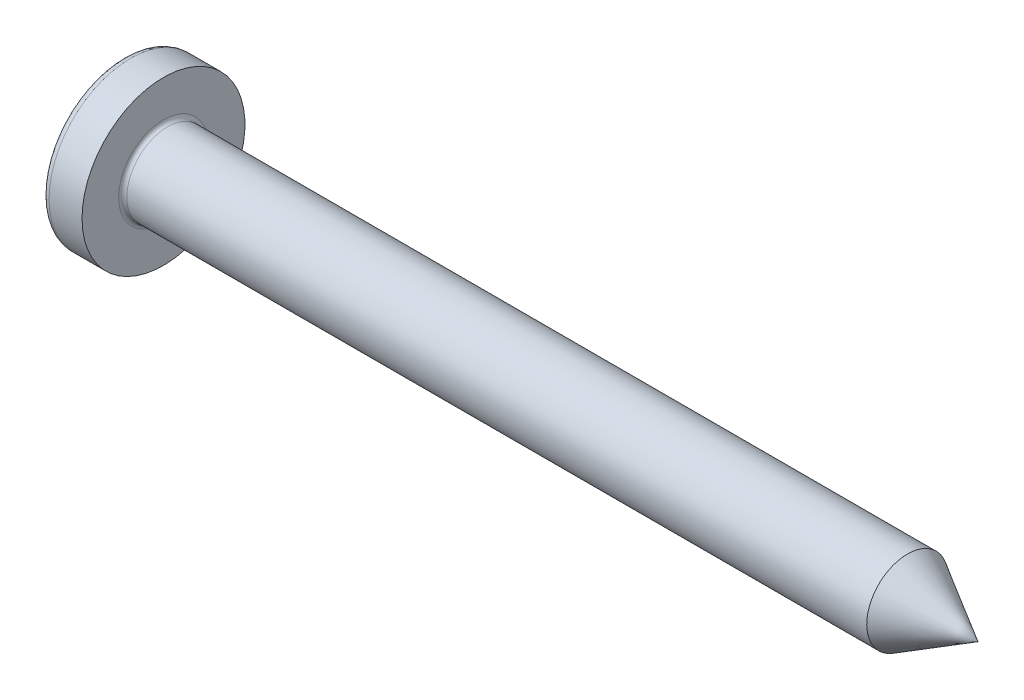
ISO-10303-21;
HEADER;
FILE_DESCRIPTION(('STEP AP214'),'2;1');
FILE_NAME('part.step','',(''),(''),'','','');
FILE_SCHEMA(('AUTOMOTIVE_DESIGN { 1 0 10303 214 1 1 1 1 }'));
ENDSEC;
DATA;
#1=APPLICATION_CONTEXT('core data for automotive mechanical design processes');
#2=APPLICATION_PROTOCOL_DEFINITION('international standard','automotive_design',2000,#1);
#3=PRODUCT_CONTEXT('',#1,'mechanical');
#4=PRODUCT('Part','Part','',(#3));
#5=PRODUCT_RELATED_PRODUCT_CATEGORY('part','',(#4));
#6=PRODUCT_DEFINITION_FORMATION('','',#4);
#7=PRODUCT_DEFINITION_CONTEXT('part definition',#1,'design');
#8=PRODUCT_DEFINITION('design','',#6,#7);
#9=PRODUCT_DEFINITION_SHAPE('','',#8);
#10=(LENGTH_UNIT() NAMED_UNIT(*) SI_UNIT(.MILLI.,.METRE.));
#11=(NAMED_UNIT(*) PLANE_ANGLE_UNIT() SI_UNIT($,.RADIAN.));
#12=(NAMED_UNIT(*) SI_UNIT($,.STERADIAN.) SOLID_ANGLE_UNIT());
#13=UNCERTAINTY_MEASURE_WITH_UNIT(LENGTH_MEASURE(1.E-05),#10,'distance_accuracy_value','');
#14=(GEOMETRIC_REPRESENTATION_CONTEXT(3) GLOBAL_UNCERTAINTY_ASSIGNED_CONTEXT((#13)) GLOBAL_UNIT_ASSIGNED_CONTEXT((#10,
#11,#12)) REPRESENTATION_CONTEXT('',''));
#15=CARTESIAN_POINT('',(0.,0.,0.));
#16=DIRECTION('',(0.,0.,1.));
#17=DIRECTION('',(1.,0.,0.));
#18=AXIS2_PLACEMENT_3D('',#15,#16,#17);
#19=CARTESIAN_POINT('',(3.2,0.,0.));
#20=DIRECTION('',(-1.,0.,0.));
#21=DIRECTION('',(0.,1.,0.));
#22=AXIS2_PLACEMENT_3D('',#19,#20,#21);
#23=SPHERICAL_SURFACE('',#22,3.2);
#24=CARTESIAN_POINT('',(0.646379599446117,0.,0.));
#25=DIRECTION('',(-1.,0.,0.));
#26=DIRECTION('',(0.,0.,1.));
#27=AXIS2_PLACEMENT_3D('',#24,#25,#26);
#28=CIRCLE('',#27,1.92847682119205);
#29=CARTESIAN_POINT('',(0.646379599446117,0.,1.92847682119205));
#30=VERTEX_POINT('',#29);
#31=EDGE_CURVE('E338',#30,#30,#28,.T.);
#32=ORIENTED_EDGE('',*,*,#31,.T.);
#33=EDGE_LOOP('',(#32));
#34=FACE_BOUND('',#33,.T.);
#35=CARTESIAN_POINT('',(0.0321614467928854,0.,0.));
#36=DIRECTION('',(1.,0.,0.));
#37=DIRECTION('',(0.,0.,-1.));
#38=AXIS2_PLACEMENT_3D('',#35,#36,#37);
#39=CIRCLE('',#38,0.452547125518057);
#40=CARTESIAN_POINT('',(0.0321614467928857,-0.239999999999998,-0.38366508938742));
#41=VERTEX_POINT('',#40);
#42=CARTESIAN_POINT('',(0.0321614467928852,-0.383665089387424,-0.24));
#43=VERTEX_POINT('',#42);
#44=EDGE_CURVE('E409',#41,#43,#39,.F.);
#45=ORIENTED_EDGE('',*,*,#44,.F.);
#46=CARTESIAN_POINT('',(3.2,-0.24,0.));
#47=DIRECTION('',(0.,1.,0.));
#48=DIRECTION('',(0.,0.,1.));
#49=AXIS2_PLACEMENT_3D('',#46,#47,#48);
#50=CIRCLE('',#49,3.19098730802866);
#51=CARTESIAN_POINT('',(0.160076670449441,-0.239999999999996,-0.970188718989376));
#52=VERTEX_POINT('',#51);
#53=EDGE_CURVE('E371',#52,#41,#50,.T.);
#54=ORIENTED_EDGE('',*,*,#53,.F.);
#55=CARTESIAN_POINT('',(2.98218770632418,0.,0.436863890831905));
#56=DIRECTION('',(0.446197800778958,0.,-0.89493436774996));
#57=DIRECTION('',(-0.89493436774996,0.,-0.446197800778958));
#58=AXIS2_PLACEMENT_3D('',#55,#56,#57);
#59=CIRCLE('',#58,3.16254766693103);
#60=CARTESIAN_POINT('',(0.160076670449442,0.240000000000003,-0.970188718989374));
#61=VERTEX_POINT('',#60);
#62=EDGE_CURVE('E207',#52,#61,#59,.T.);
#63=ORIENTED_EDGE('',*,*,#62,.T.);
#64=CARTESIAN_POINT('',(3.2,0.24,0.));
#65=DIRECTION('',(0.,-1.,0.));
#66=DIRECTION('',(0.,0.,-1.));
#67=AXIS2_PLACEMENT_3D('',#64,#65,#66);
#68=CIRCLE('',#67,3.19098730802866);
#69=CARTESIAN_POINT('',(0.0321614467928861,0.240000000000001,-0.383665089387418));
#70=VERTEX_POINT('',#69);
#71=EDGE_CURVE('E370',#70,#61,#68,.T.);
#72=ORIENTED_EDGE('',*,*,#71,.F.);
#73=CARTESIAN_POINT('',(0.0321614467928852,0.383665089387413,-0.24));
#74=VERTEX_POINT('',#73);
#75=EDGE_CURVE('E413',#74,#70,#39,.F.);
#76=ORIENTED_EDGE('',*,*,#75,.F.);
#77=CARTESIAN_POINT('',(3.2,0.,-0.24));
#78=DIRECTION('',(0.,0.,1.));
#79=DIRECTION('',(1.,0.,0.));
#80=AXIS2_PLACEMENT_3D('',#77,#78,#79);
#81=CIRCLE('',#80,3.19098730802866);
#82=CARTESIAN_POINT('',(0.160076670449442,0.970188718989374,-0.24));
#83=VERTEX_POINT('',#82);
#84=EDGE_CURVE('E201',#83,#74,#81,.T.);
#85=ORIENTED_EDGE('',*,*,#84,.F.);
#86=CARTESIAN_POINT('',(2.98218770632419,-0.436863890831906,0.));
#87=DIRECTION('',(0.446197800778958,0.89493436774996,0.));
#88=DIRECTION('',(-0.89493436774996,0.446197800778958,0.));
#89=AXIS2_PLACEMENT_3D('',#86,#87,#88);
#90=CIRCLE('',#89,3.16254766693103);
#91=CARTESIAN_POINT('',(0.160076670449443,0.970188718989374,0.24));
#92=VERTEX_POINT('',#91);
#93=EDGE_CURVE('E204',#83,#92,#90,.T.);
#94=ORIENTED_EDGE('',*,*,#93,.T.);
#95=CARTESIAN_POINT('',(3.2,0.,0.24));
#96=DIRECTION('',(0.,0.,-1.));
#97=DIRECTION('',(-1.,0.,0.));
#98=AXIS2_PLACEMENT_3D('',#95,#96,#97);
#99=CIRCLE('',#98,3.19098730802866);
#100=CARTESIAN_POINT('',(0.0321614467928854,0.383665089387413,0.239999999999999));
#101=VERTEX_POINT('',#100);
#102=EDGE_CURVE('E190',#101,#92,#99,.T.);
#103=ORIENTED_EDGE('',*,*,#102,.F.);
#104=CARTESIAN_POINT('',(0.0321614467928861,0.239999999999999,0.38366508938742));
#105=VERTEX_POINT('',#104);
#106=EDGE_CURVE('E275',#105,#101,#39,.F.);
#107=ORIENTED_EDGE('',*,*,#106,.F.);
#108=CARTESIAN_POINT('',(0.160076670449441,0.239999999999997,0.970188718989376));
#109=VERTEX_POINT('',#108);
#110=EDGE_CURVE('E368',#109,#105,#68,.T.);
#111=ORIENTED_EDGE('',*,*,#110,.F.);
#112=CARTESIAN_POINT('',(2.98218770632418,0.,-0.436863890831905));
#113=DIRECTION('',(0.446197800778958,0.,0.89493436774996));
#114=DIRECTION('',(0.89493436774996,0.,-0.446197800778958));
#115=AXIS2_PLACEMENT_3D('',#112,#113,#114);
#116=CIRCLE('',#115,3.16254766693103);
#117=CARTESIAN_POINT('',(0.160076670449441,-0.240000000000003,0.970188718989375));
#118=VERTEX_POINT('',#117);
#119=EDGE_CURVE('E210',#109,#118,#116,.T.);
#120=ORIENTED_EDGE('',*,*,#119,.T.);
#121=CARTESIAN_POINT('',(0.0321614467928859,-0.240000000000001,0.383665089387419));
#122=VERTEX_POINT('',#121);
#123=EDGE_CURVE('E372',#122,#118,#50,.T.);
#124=ORIENTED_EDGE('',*,*,#123,.F.);
#125=CARTESIAN_POINT('',(0.0321614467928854,-0.383665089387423,0.239999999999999));
#126=VERTEX_POINT('',#125);
#127=EDGE_CURVE('E408',#126,#122,#39,.F.);
#128=ORIENTED_EDGE('',*,*,#127,.F.);
#129=CARTESIAN_POINT('',(0.160076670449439,-0.970188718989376,0.239999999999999));
#130=VERTEX_POINT('',#129);
#131=EDGE_CURVE('E197',#130,#126,#99,.T.);
#132=ORIENTED_EDGE('',*,*,#131,.F.);
#133=CARTESIAN_POINT('',(2.98218770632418,0.436863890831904,0.));
#134=DIRECTION('',(0.446197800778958,-0.89493436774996,0.));
#135=DIRECTION('',(0.89493436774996,0.446197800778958,0.));
#136=AXIS2_PLACEMENT_3D('',#133,#134,#135);
#137=CIRCLE('',#136,3.16254766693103);
#138=CARTESIAN_POINT('',(0.160076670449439,-0.970188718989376,-0.24));
#139=VERTEX_POINT('',#138);
#140=EDGE_CURVE('E186',#130,#139,#137,.T.);
#141=ORIENTED_EDGE('',*,*,#140,.T.);
#142=EDGE_CURVE('E200',#43,#139,#81,.T.);
#143=ORIENTED_EDGE('',*,*,#142,.F.);
#144=EDGE_LOOP('',(#45,#54,#63,#72,#76,#85,#94,#103,#107,#111,#120,#124,#128,#132,#141,#143));
#145=FACE_BOUND('',#144,.T.);
#146=ADVANCED_FACE('F31',(#34,#145),#23,.T.);
#147=CARTESIAN_POINT('',(1.42,0.342014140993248,-0.24));
#148=DIRECTION('',(0.,0.,1.));
#149=DIRECTION('',(1.,0.,0.));
#150=AXIS2_PLACEMENT_3D('',#147,#148,#149);
#151=PLANE('',#150);
#152=ORIENTED_EDGE('',*,*,#84,.T.);
#153=CARTESIAN_POINT('',(-0.626811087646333,0.437068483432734,-0.24));
#154=CARTESIAN_POINT('',(-0.489788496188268,0.426133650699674,-0.24));
#155=CARTESIAN_POINT('',(-0.35277275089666,0.415111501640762,-0.24));
#156=CARTESIAN_POINT('',(-0.0787578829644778,0.392826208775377,-0.24));
#157=CARTESIAN_POINT('',(0.0582412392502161,0.381563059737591,-0.24));
#158=CARTESIAN_POINT('',(0.332213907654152,0.358729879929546,-0.24));
#159=CARTESIAN_POINT('',(0.469187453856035,0.347159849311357,-0.24));
#160=CARTESIAN_POINT('',(0.743097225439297,0.323608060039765,-0.24));
#161=CARTESIAN_POINT('',(0.880033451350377,0.311626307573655,-0.24));
#162=CARTESIAN_POINT('',(1.12503843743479,0.289667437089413,-0.24));
#163=CARTESIAN_POINT('',(1.23311691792,0.279799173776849,-0.24));
#164=CARTESIAN_POINT('',(1.4492267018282,0.259570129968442,-0.24));
#165=CARTESIAN_POINT('',(1.55725800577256,0.249209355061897,-0.24));
#166=CARTESIAN_POINT('',(1.77325939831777,0.227783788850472,-0.24));
#167=CARTESIAN_POINT('',(1.88122948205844,0.216718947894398,-0.24));
#168=CARTESIAN_POINT('',(2.04309848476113,0.199296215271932,-0.24));
#169=CARTESIAN_POINT('',(2.09704158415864,0.193350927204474,-0.24));
#170=CARTESIAN_POINT('',(2.20488609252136,0.181086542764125,-0.24));
#171=CARTESIAN_POINT('',(2.25878750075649,0.174767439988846,-0.24));
#172=CARTESIAN_POINT('',(2.31266102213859,0.168212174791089,-0.24));
#173=B_SPLINE_CURVE_WITH_KNOTS('',3,(#153,#154,#155,#156,#157,#158,#159,#160,#161,#162,#163,
#164,#165,#166,#167,#168,#169,#170,#171,#172),.UNSPECIFIED.,.F.,.F.,(4,2,2,2,2,2,2,2,2,4),(0.,
0.412374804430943,0.824758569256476,1.23714212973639,1.64951949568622,1.97510284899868,
2.30068250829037,2.62628515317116,2.78909323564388,2.95190410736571),.UNSPECIFIED.);
#174=CARTESIAN_POINT('',(1.42,0.262259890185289,-0.240000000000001));
#175=VERTEX_POINT('',#174);
#176=EDGE_CURVE('E251',#74,#175,#173,.T.);
#177=ORIENTED_EDGE('',*,*,#176,.T.);
#178=DIRECTION('',(0.,1.,0.));
#179=VECTOR('',#178,1.);
#180=CARTESIAN_POINT('',(1.42,-0.342014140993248,-0.24));
#181=LINE('',#180,#179);
#182=CARTESIAN_POINT('',(1.42,0.342014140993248,-0.24));
#183=VERTEX_POINT('',#182);
#184=EDGE_CURVE('E347',#175,#183,#181,.T.);
#185=ORIENTED_EDGE('',*,*,#184,.T.);
#186=DIRECTION('',(0.89493436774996,-0.446197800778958,0.));
#187=VECTOR('',#186,1.);
#188=CARTESIAN_POINT('',(0.,1.05,-0.24));
#189=LINE('',#188,#187);
#190=EDGE_CURVE('E342',#83,#183,#189,.T.);
#191=ORIENTED_EDGE('',*,*,#190,.F.);
#192=EDGE_LOOP('',(#152,#177,#185,#191));
#193=FACE_BOUND('',#192,.T.);
#194=ADVANCED_FACE('F302',(#193),#151,.T.);
#195=CARTESIAN_POINT('',(1.42,-0.342014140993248,-0.24));
#196=VERTEX_POINT('',#195);
#197=CARTESIAN_POINT('',(1.42,-0.262259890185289,-0.240000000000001));
#198=VERTEX_POINT('',#197);
#199=EDGE_CURVE('E343',#196,#198,#181,.T.);
#200=ORIENTED_EDGE('',*,*,#199,.T.);
#201=CARTESIAN_POINT('',(-0.626811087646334,-0.437068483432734,-0.24));
#202=CARTESIAN_POINT('',(-0.489788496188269,-0.426133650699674,-0.24));
#203=CARTESIAN_POINT('',(-0.352772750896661,-0.415111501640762,-0.24));
#204=CARTESIAN_POINT('',(-0.0787578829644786,-0.392826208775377,-0.24));
#205=CARTESIAN_POINT('',(0.0582412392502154,-0.381563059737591,-0.24));
#206=CARTESIAN_POINT('',(0.332213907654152,-0.358729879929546,-0.24));
#207=CARTESIAN_POINT('',(0.469187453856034,-0.347159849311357,-0.24));
#208=CARTESIAN_POINT('',(0.743097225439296,-0.323608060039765,-0.24));
#209=CARTESIAN_POINT('',(0.880033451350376,-0.311626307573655,-0.24));
#210=CARTESIAN_POINT('',(1.12503843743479,-0.289667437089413,-0.24));
#211=CARTESIAN_POINT('',(1.23311691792,-0.279799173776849,-0.24));
#212=CARTESIAN_POINT('',(1.4492267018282,-0.259570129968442,-0.24));
#213=CARTESIAN_POINT('',(1.55725800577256,-0.249209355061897,-0.24));
#214=CARTESIAN_POINT('',(1.77325939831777,-0.227783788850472,-0.24));
#215=CARTESIAN_POINT('',(1.88122948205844,-0.216718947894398,-0.24));
#216=CARTESIAN_POINT('',(2.04309848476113,-0.199296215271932,-0.24));
#217=CARTESIAN_POINT('',(2.09704158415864,-0.193350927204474,-0.24));
#218=CARTESIAN_POINT('',(2.20488609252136,-0.181086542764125,-0.24));
#219=CARTESIAN_POINT('',(2.25878750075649,-0.174767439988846,-0.24));
#220=CARTESIAN_POINT('',(2.31266102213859,-0.168212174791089,-0.24));
#221=B_SPLINE_CURVE_WITH_KNOTS('',3,(#201,#202,#203,#204,#205,#206,#207,#208,#209,#210,#211,
#212,#213,#214,#215,#216,#217,#218,#219,#220),.UNSPECIFIED.,.F.,.F.,(4,2,2,2,2,2,2,2,2,4),(0.,
0.412374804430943,0.824758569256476,1.23714212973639,1.64951949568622,1.97510284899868,
2.30068250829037,2.62628515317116,2.78909323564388,2.95190410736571),.UNSPECIFIED.);
#222=EDGE_CURVE('E237',#198,#43,#221,.F.);
#223=ORIENTED_EDGE('',*,*,#222,.T.);
#224=ORIENTED_EDGE('',*,*,#142,.T.);
#225=DIRECTION('',(0.89493436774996,0.446197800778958,0.));
#226=VECTOR('',#225,1.);
#227=CARTESIAN_POINT('',(0.,-1.05,-0.24));
#228=LINE('',#227,#226);
#229=EDGE_CURVE('E362',#139,#196,#228,.T.);
#230=ORIENTED_EDGE('',*,*,#229,.T.);
#231=EDGE_LOOP('',(#200,#223,#224,#230));
#232=FACE_BOUND('',#231,.T.);
#233=ADVANCED_FACE('F308',(#232),#151,.T.);
#234=CARTESIAN_POINT('',(1.42,-0.342014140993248,0.24));
#235=DIRECTION('',(0.,0.,-1.));
#236=DIRECTION('',(-1.,0.,0.));
#237=AXIS2_PLACEMENT_3D('',#234,#235,#236);
#238=PLANE('',#237);
#239=DIRECTION('',(0.,-1.,0.));
#240=VECTOR('',#239,1.);
#241=CARTESIAN_POINT('',(1.42,0.342014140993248,0.24));
#242=LINE('',#241,#240);
#243=CARTESIAN_POINT('',(1.42,0.342014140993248,0.24));
#244=VERTEX_POINT('',#243);
#245=CARTESIAN_POINT('',(1.42,0.262259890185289,0.240000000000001));
#246=VERTEX_POINT('',#245);
#247=EDGE_CURVE('E352',#244,#246,#242,.T.);
#248=ORIENTED_EDGE('',*,*,#247,.T.);
#249=CARTESIAN_POINT('',(-0.626811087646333,0.437068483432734,0.239999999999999));
#250=CARTESIAN_POINT('',(-0.489788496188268,0.426133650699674,0.239999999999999));
#251=CARTESIAN_POINT('',(-0.35277275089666,0.415111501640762,0.239999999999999));
#252=CARTESIAN_POINT('',(-0.0787578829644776,0.392826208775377,0.239999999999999));
#253=CARTESIAN_POINT('',(0.0582412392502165,0.381563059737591,0.239999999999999));
#254=CARTESIAN_POINT('',(0.332213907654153,0.358729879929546,0.239999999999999));
#255=CARTESIAN_POINT('',(0.469187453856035,0.347159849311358,0.239999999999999));
#256=CARTESIAN_POINT('',(0.743097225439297,0.323608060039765,0.24));
#257=CARTESIAN_POINT('',(0.880033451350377,0.311626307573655,0.24));
#258=CARTESIAN_POINT('',(1.12503843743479,0.289667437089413,0.24));
#259=CARTESIAN_POINT('',(1.23311691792,0.279799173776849,0.24));
#260=CARTESIAN_POINT('',(1.4492267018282,0.259570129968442,0.24));
#261=CARTESIAN_POINT('',(1.55725800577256,0.249209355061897,0.24));
#262=CARTESIAN_POINT('',(1.77325939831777,0.227783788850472,0.24));
#263=CARTESIAN_POINT('',(1.88122948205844,0.216718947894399,0.24));
#264=CARTESIAN_POINT('',(2.04309848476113,0.199296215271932,0.24));
#265=CARTESIAN_POINT('',(2.09704158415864,0.193350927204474,0.24));
#266=CARTESIAN_POINT('',(2.20488609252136,0.181086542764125,0.24));
#267=CARTESIAN_POINT('',(2.25878750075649,0.174767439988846,0.24));
#268=CARTESIAN_POINT('',(2.31266102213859,0.168212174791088,0.24));
#269=B_SPLINE_CURVE_WITH_KNOTS('',3,(#249,#250,#251,#252,#253,#254,#255,#256,#257,#258,#259,
#260,#261,#262,#263,#264,#265,#266,#267,#268),.UNSPECIFIED.,.F.,.F.,(4,2,2,2,2,2,2,2,2,4),(0.,
0.412374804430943,0.824758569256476,1.23714212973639,1.64951949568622,1.97510284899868,
2.30068250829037,2.62628515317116,2.78909323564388,2.95190410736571),.UNSPECIFIED.);
#270=EDGE_CURVE('E276',#246,#101,#269,.F.);
#271=ORIENTED_EDGE('',*,*,#270,.T.);
#272=ORIENTED_EDGE('',*,*,#102,.T.);
#273=DIRECTION('',(0.89493436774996,-0.446197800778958,0.));
#274=VECTOR('',#273,1.);
#275=CARTESIAN_POINT('',(0.,1.05,0.24));
#276=LINE('',#275,#274);
#277=EDGE_CURVE('E364',#92,#244,#276,.T.);
#278=ORIENTED_EDGE('',*,*,#277,.T.);
#279=EDGE_LOOP('',(#248,#271,#272,#278));
#280=FACE_BOUND('',#279,.T.);
#281=ADVANCED_FACE('F446',(#280),#238,.T.);
#282=ORIENTED_EDGE('',*,*,#131,.T.);
#283=CARTESIAN_POINT('',(-0.626811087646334,-0.437068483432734,0.239999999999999));
#284=CARTESIAN_POINT('',(-0.489788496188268,-0.426133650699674,0.239999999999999));
#285=CARTESIAN_POINT('',(-0.35277275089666,-0.415111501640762,0.239999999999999));
#286=CARTESIAN_POINT('',(-0.0787578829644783,-0.392826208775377,0.239999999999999));
#287=CARTESIAN_POINT('',(0.0582412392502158,-0.381563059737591,0.239999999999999));
#288=CARTESIAN_POINT('',(0.332213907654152,-0.358729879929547,0.239999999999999));
#289=CARTESIAN_POINT('',(0.469187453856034,-0.347159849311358,0.239999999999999));
#290=CARTESIAN_POINT('',(0.743097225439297,-0.323608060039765,0.24));
#291=CARTESIAN_POINT('',(0.880033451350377,-0.311626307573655,0.24));
#292=CARTESIAN_POINT('',(1.12503843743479,-0.289667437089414,0.24));
#293=CARTESIAN_POINT('',(1.23311691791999,-0.279799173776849,0.24));
#294=CARTESIAN_POINT('',(1.4492267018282,-0.259570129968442,0.24));
#295=CARTESIAN_POINT('',(1.55725800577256,-0.249209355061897,0.24));
#296=CARTESIAN_POINT('',(1.77325939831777,-0.227783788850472,0.24));
#297=CARTESIAN_POINT('',(1.88122948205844,-0.216718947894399,0.24));
#298=CARTESIAN_POINT('',(2.04309848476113,-0.199296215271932,0.24));
#299=CARTESIAN_POINT('',(2.09704158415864,-0.193350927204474,0.24));
#300=CARTESIAN_POINT('',(2.20488609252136,-0.181086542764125,0.24));
#301=CARTESIAN_POINT('',(2.25878750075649,-0.174767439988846,0.24));
#302=CARTESIAN_POINT('',(2.31266102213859,-0.168212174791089,0.24));
#303=B_SPLINE_CURVE_WITH_KNOTS('',3,(#283,#284,#285,#286,#287,#288,#289,#290,#291,#292,#293,
#294,#295,#296,#297,#298,#299,#300,#301,#302),.UNSPECIFIED.,.F.,.F.,(4,2,2,2,2,2,2,2,2,4),(0.,
0.412374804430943,0.824758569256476,1.23714212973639,1.64951949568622,1.97510284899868,
2.30068250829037,2.62628515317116,2.78909323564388,2.95190410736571),.UNSPECIFIED.);
#304=CARTESIAN_POINT('',(1.42,-0.262259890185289,0.240000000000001));
#305=VERTEX_POINT('',#304);
#306=EDGE_CURVE('E264',#126,#305,#303,.T.);
#307=ORIENTED_EDGE('',*,*,#306,.T.);
#308=CARTESIAN_POINT('',(1.42,-0.342014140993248,0.24));
#309=VERTEX_POINT('',#308);
#310=EDGE_CURVE('E351',#305,#309,#242,.T.);
#311=ORIENTED_EDGE('',*,*,#310,.T.);
#312=DIRECTION('',(0.89493436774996,0.446197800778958,0.));
#313=VECTOR('',#312,1.);
#314=CARTESIAN_POINT('',(0.,-1.05,0.239999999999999));
#315=LINE('',#314,#313);
#316=EDGE_CURVE('E359',#130,#309,#315,.T.);
#317=ORIENTED_EDGE('',*,*,#316,.F.);
#318=EDGE_LOOP('',(#282,#307,#311,#317));
#319=FACE_BOUND('',#318,.T.);
#320=ADVANCED_FACE('F506',(#319),#238,.T.);
#321=CARTESIAN_POINT('',(1.42,0.342014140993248,0.24));
#322=DIRECTION('',(0.446197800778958,0.89493436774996,0.));
#323=DIRECTION('',(-0.89493436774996,0.446197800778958,0.));
#324=AXIS2_PLACEMENT_3D('',#321,#322,#323);
#325=PLANE('',#324);
#326=CARTESIAN_POINT('',(2.01772939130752,0.0439972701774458,0.));
#327=DIRECTION('',(0.446197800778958,0.89493436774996,0.));
#328=DIRECTION('',(-0.89493436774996,0.446197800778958,0.));
#329=AXIS2_PLACEMENT_3D('',#326,#327,#328);
#330=ELLIPSE('',#329,0.703057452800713,0.310602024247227);
#331=CARTESIAN_POINT('',(1.42,0.342014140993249,0.0969875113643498));
#332=VERTEX_POINT('',#331);
#333=CARTESIAN_POINT('',(1.42,0.342014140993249,-0.0969875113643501));
#334=VERTEX_POINT('',#333);
#335=EDGE_CURVE('E400',#332,#334,#330,.F.);
#336=ORIENTED_EDGE('',*,*,#335,.F.);
#337=DIRECTION('',(0.,0.,-1.));
#338=VECTOR('',#337,1.);
#339=CARTESIAN_POINT('',(1.42,0.342014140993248,0.24));
#340=LINE('',#339,#338);
#341=EDGE_CURVE('E348',#244,#332,#340,.T.);
#342=ORIENTED_EDGE('',*,*,#341,.F.);
#343=ORIENTED_EDGE('',*,*,#277,.F.);
#344=ORIENTED_EDGE('',*,*,#93,.F.);
#345=ORIENTED_EDGE('',*,*,#190,.T.);
#346=EDGE_CURVE('E346',#334,#183,#340,.T.);
#347=ORIENTED_EDGE('',*,*,#346,.F.);
#348=EDGE_LOOP('',(#336,#342,#343,#344,#345,#347));
#349=FACE_BOUND('',#348,.T.);
#350=ADVANCED_FACE('F442',(#349),#325,.F.);
#351=CARTESIAN_POINT('',(1.42,-0.342014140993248,-0.24));
#352=DIRECTION('',(0.446197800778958,-0.89493436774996,0.));
#353=DIRECTION('',(0.89493436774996,0.446197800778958,0.));
#354=AXIS2_PLACEMENT_3D('',#351,#352,#353);
#355=PLANE('',#354);
#356=CARTESIAN_POINT('',(2.01772939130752,-0.0439972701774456,0.));
#357=DIRECTION('',(0.446197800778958,-0.89493436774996,0.));
#358=DIRECTION('',(-0.89493436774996,-0.446197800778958,0.));
#359=AXIS2_PLACEMENT_3D('',#356,#357,#358);
#360=ELLIPSE('',#359,0.703057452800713,0.310602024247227);
#361=CARTESIAN_POINT('',(1.42,-0.342014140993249,-0.0969875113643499));
#362=VERTEX_POINT('',#361);
#363=CARTESIAN_POINT('',(1.42,-0.342014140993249,0.0969875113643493));
#364=VERTEX_POINT('',#363);
#365=EDGE_CURVE('E401',#362,#364,#360,.F.);
#366=ORIENTED_EDGE('',*,*,#365,.F.);
#367=DIRECTION('',(0.,0.,1.));
#368=VECTOR('',#367,1.);
#369=CARTESIAN_POINT('',(1.42,-0.342014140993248,-0.24));
#370=LINE('',#369,#368);
#371=EDGE_CURVE('E356',#196,#362,#370,.T.);
#372=ORIENTED_EDGE('',*,*,#371,.F.);
#373=ORIENTED_EDGE('',*,*,#229,.F.);
#374=ORIENTED_EDGE('',*,*,#140,.F.);
#375=ORIENTED_EDGE('',*,*,#316,.T.);
#376=EDGE_CURVE('E355',#364,#309,#370,.T.);
#377=ORIENTED_EDGE('',*,*,#376,.F.);
#378=EDGE_LOOP('',(#366,#372,#373,#374,#375,#377));
#379=FACE_BOUND('',#378,.T.);
#380=ADVANCED_FACE('F495',(#379),#355,.F.);
#381=CARTESIAN_POINT('',(1.42,0.342014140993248,-0.24));
#382=DIRECTION('',(-1.,0.,0.));
#383=DIRECTION('',(0.,0.,1.));
#384=AXIS2_PLACEMENT_3D('',#381,#382,#383);
#385=PLANE('',#384);
#386=DIRECTION('',(0.,1.,0.));
#387=VECTOR('',#386,1.);
#388=CARTESIAN_POINT('',(1.42,-0.240000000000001,0.342014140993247));
#389=LINE('',#388,#387);
#390=CARTESIAN_POINT('',(1.42,-0.240000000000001,0.342014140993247));
#391=VERTEX_POINT('',#390);
#392=CARTESIAN_POINT('',(1.42,-0.0969875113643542,0.342014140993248));
#393=VERTEX_POINT('',#392);
#394=EDGE_CURVE('E380',#391,#393,#389,.T.);
#395=ORIENTED_EDGE('',*,*,#394,.T.);
#396=CARTESIAN_POINT('',(1.42,0.,0.));
#397=DIRECTION('',(-1.,0.,0.));
#398=DIRECTION('',(0.,0.,1.));
#399=AXIS2_PLACEMENT_3D('',#396,#397,#398);
#400=CIRCLE('',#399,0.3555);
#401=CARTESIAN_POINT('',(1.42,-0.240000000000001,0.262259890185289));
#402=VERTEX_POINT('',#401);
#403=EDGE_CURVE('E472',#402,#393,#400,.T.);
#404=ORIENTED_EDGE('',*,*,#403,.F.);
#405=DIRECTION('',(0.,0.,-1.));
#406=VECTOR('',#405,1.);
#407=CARTESIAN_POINT('',(1.42,-0.240000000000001,0.342014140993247));
#408=LINE('',#407,#406);
#409=EDGE_CURVE('E384',#391,#402,#408,.T.);
#410=ORIENTED_EDGE('',*,*,#409,.F.);
#411=EDGE_LOOP('',(#395,#404,#410));
#412=FACE_BOUND('',#411,.T.);
#413=ADVANCED_FACE('F296',(#412),#385,.T.);
#414=ORIENTED_EDGE('',*,*,#310,.F.);
#415=EDGE_CURVE('E466',#364,#305,#400,.T.);
#416=ORIENTED_EDGE('',*,*,#415,.F.);
#417=ORIENTED_EDGE('',*,*,#376,.T.);
#418=EDGE_LOOP('',(#414,#416,#417));
#419=FACE_BOUND('',#418,.T.);
#420=ADVANCED_FACE('F494',(#419),#385,.T.);
#421=ORIENTED_EDGE('',*,*,#371,.T.);
#422=EDGE_CURVE('E462',#198,#362,#400,.T.);
#423=ORIENTED_EDGE('',*,*,#422,.F.);
#424=ORIENTED_EDGE('',*,*,#199,.F.);
#425=EDGE_LOOP('',(#421,#423,#424));
#426=FACE_BOUND('',#425,.T.);
#427=ADVANCED_FACE('F500',(#426),#385,.T.);
#428=CARTESIAN_POINT('',(1.42,-0.239999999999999,-0.262259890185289));
#429=VERTEX_POINT('',#428);
#430=CARTESIAN_POINT('',(1.42,-0.239999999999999,-0.342014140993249));
#431=VERTEX_POINT('',#430);
#432=EDGE_CURVE('E383',#429,#431,#408,.T.);
#433=ORIENTED_EDGE('',*,*,#432,.F.);
#434=CARTESIAN_POINT('',(1.42,-0.0969875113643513,-0.342014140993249));
#435=VERTEX_POINT('',#434);
#436=EDGE_CURVE('E47',#435,#429,#400,.T.);
#437=ORIENTED_EDGE('',*,*,#436,.F.);
#438=DIRECTION('',(0.,-1.,0.));
#439=VECTOR('',#438,1.);
#440=CARTESIAN_POINT('',(1.42,0.240000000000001,-0.342014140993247));
#441=LINE('',#440,#439);
#442=EDGE_CURVE('E387',#435,#431,#441,.T.);
#443=ORIENTED_EDGE('',*,*,#442,.T.);
#444=EDGE_LOOP('',(#433,#437,#443));
#445=FACE_BOUND('',#444,.T.);
#446=ADVANCED_FACE('F524',(#445),#385,.T.);
#447=CARTESIAN_POINT('',(1.42,0.240000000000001,-0.342014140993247));
#448=VERTEX_POINT('',#447);
#449=CARTESIAN_POINT('',(1.42,0.0969875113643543,-0.342014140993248));
#450=VERTEX_POINT('',#449);
#451=EDGE_CURVE('E388',#448,#450,#441,.T.);
#452=ORIENTED_EDGE('',*,*,#451,.T.);
#453=CARTESIAN_POINT('',(1.42,0.240000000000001,-0.262259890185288));
#454=VERTEX_POINT('',#453);
#455=EDGE_CURVE('E456',#454,#450,#400,.T.);
#456=ORIENTED_EDGE('',*,*,#455,.F.);
#457=DIRECTION('',(0.,0.,1.));
#458=VECTOR('',#457,1.);
#459=CARTESIAN_POINT('',(1.42,0.240000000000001,-0.342014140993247));
#460=LINE('',#459,#458);
#461=EDGE_CURVE('E375',#448,#454,#460,.T.);
#462=ORIENTED_EDGE('',*,*,#461,.F.);
#463=EDGE_LOOP('',(#452,#456,#462));
#464=FACE_BOUND('',#463,.T.);
#465=ADVANCED_FACE('F522',(#464),#385,.T.);
#466=ORIENTED_EDGE('',*,*,#184,.F.);
#467=EDGE_CURVE('E439',#334,#175,#400,.T.);
#468=ORIENTED_EDGE('',*,*,#467,.F.);
#469=ORIENTED_EDGE('',*,*,#346,.T.);
#470=EDGE_LOOP('',(#466,#468,#469));
#471=FACE_BOUND('',#470,.T.);
#472=ADVANCED_FACE('F437',(#471),#385,.T.);
#473=ORIENTED_EDGE('',*,*,#341,.T.);
#474=EDGE_CURVE('E451',#246,#332,#400,.T.);
#475=ORIENTED_EDGE('',*,*,#474,.F.);
#476=ORIENTED_EDGE('',*,*,#247,.F.);
#477=EDGE_LOOP('',(#473,#475,#476));
#478=FACE_BOUND('',#477,.T.);
#479=ADVANCED_FACE('F293',(#478),#385,.T.);
#480=CARTESIAN_POINT('',(1.42,0.239999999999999,0.26225989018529));
#481=VERTEX_POINT('',#480);
#482=CARTESIAN_POINT('',(1.42,0.239999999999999,0.342014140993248));
#483=VERTEX_POINT('',#482);
#484=EDGE_CURVE('E379',#481,#483,#460,.T.);
#485=ORIENTED_EDGE('',*,*,#484,.F.);
#486=CARTESIAN_POINT('',(1.42,0.0969875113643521,0.342014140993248));
#487=VERTEX_POINT('',#486);
#488=EDGE_CURVE('E414',#487,#481,#400,.T.);
#489=ORIENTED_EDGE('',*,*,#488,.F.);
#490=EDGE_CURVE('E378',#487,#483,#389,.T.);
#491=ORIENTED_EDGE('',*,*,#490,.T.);
#492=EDGE_LOOP('',(#485,#489,#491));
#493=FACE_BOUND('',#492,.T.);
#494=ADVANCED_FACE('F284',(#493),#385,.T.);
#495=CARTESIAN_POINT('',(1.42,0.239999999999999,0.342014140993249));
#496=DIRECTION('',(0.,-1.,0.));
#497=DIRECTION('',(1.,0.,0.));
#498=AXIS2_PLACEMENT_3D('',#495,#496,#497);
#499=PLANE('',#498);
#500=ORIENTED_EDGE('',*,*,#110,.T.);
#501=CARTESIAN_POINT('',(-0.626811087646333,0.239999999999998,0.437068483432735));
#502=CARTESIAN_POINT('',(-0.489788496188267,0.239999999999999,0.426133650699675));
#503=CARTESIAN_POINT('',(-0.35277275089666,0.239999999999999,0.415111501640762));
#504=CARTESIAN_POINT('',(-0.0787578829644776,0.239999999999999,0.392826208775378));
#505=CARTESIAN_POINT('',(0.0582412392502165,0.239999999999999,0.381563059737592));
#506=CARTESIAN_POINT('',(0.332213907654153,0.239999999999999,0.358729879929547));
#507=CARTESIAN_POINT('',(0.469187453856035,0.239999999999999,0.347159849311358));
#508=CARTESIAN_POINT('',(0.743097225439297,0.239999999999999,0.323608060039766));
#509=CARTESIAN_POINT('',(0.880033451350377,0.239999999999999,0.311626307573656));
#510=CARTESIAN_POINT('',(1.12503843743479,0.239999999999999,0.289667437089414));
#511=CARTESIAN_POINT('',(1.23311691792,0.239999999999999,0.279799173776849));
#512=CARTESIAN_POINT('',(1.4492267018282,0.239999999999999,0.259570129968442));
#513=CARTESIAN_POINT('',(1.55725800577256,0.239999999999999,0.249209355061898));
#514=CARTESIAN_POINT('',(1.77325939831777,0.239999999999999,0.227783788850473));
#515=CARTESIAN_POINT('',(1.88122948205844,0.239999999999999,0.216718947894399));
#516=CARTESIAN_POINT('',(2.04309848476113,0.239999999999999,0.199296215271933));
#517=CARTESIAN_POINT('',(2.09704158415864,0.239999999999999,0.193350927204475));
#518=CARTESIAN_POINT('',(2.20488609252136,0.239999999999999,0.181086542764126));
#519=CARTESIAN_POINT('',(2.25878750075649,0.239999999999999,0.174767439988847));
#520=CARTESIAN_POINT('',(2.31266102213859,0.239999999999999,0.168212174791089));
#521=B_SPLINE_CURVE_WITH_KNOTS('',3,(#501,#502,#503,#504,#505,#506,#507,#508,#509,#510,#511,
#512,#513,#514,#515,#516,#517,#518,#519,#520),.UNSPECIFIED.,.F.,.F.,(4,2,2,2,2,2,2,2,2,4),(0.,
0.412374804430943,0.824758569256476,1.23714212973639,1.64951949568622,1.97510284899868,
2.30068250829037,2.62628515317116,2.78909323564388,2.95190410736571),.UNSPECIFIED.);
#522=EDGE_CURVE('E270',#105,#481,#521,.T.);
#523=ORIENTED_EDGE('',*,*,#522,.T.);
#524=ORIENTED_EDGE('',*,*,#484,.T.);
#525=DIRECTION('',(0.89493436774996,0.,-0.446197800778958));
#526=VECTOR('',#525,1.);
#527=CARTESIAN_POINT('',(0.,0.239999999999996,1.05));
#528=LINE('',#527,#526);
#529=EDGE_CURVE('E374',#109,#483,#528,.T.);
#530=ORIENTED_EDGE('',*,*,#529,.F.);
#531=EDGE_LOOP('',(#500,#523,#524,#530));
#532=FACE_BOUND('',#531,.T.);
#533=ADVANCED_FACE('F281',(#532),#499,.T.);
#534=CARTESIAN_POINT('',(1.42,-0.239999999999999,-0.342014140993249));
#535=DIRECTION('',(0.,1.,0.));
#536=DIRECTION('',(-1.,0.,0.));
#537=AXIS2_PLACEMENT_3D('',#534,#535,#536);
#538=PLANE('',#537);
#539=ORIENTED_EDGE('',*,*,#409,.T.);
#540=CARTESIAN_POINT('',(-0.626811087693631,-0.240000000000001,0.437068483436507));
#541=CARTESIAN_POINT('',(-0.489788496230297,-0.240000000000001,0.426133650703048));
#542=CARTESIAN_POINT('',(-0.352772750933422,-0.240000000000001,0.415111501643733));
#543=CARTESIAN_POINT('',(-0.0787578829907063,-0.240000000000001,0.392826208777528));
#544=CARTESIAN_POINT('',(0.0582412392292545,-0.240000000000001,0.381563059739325));
#545=CARTESIAN_POINT('',(0.332213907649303,-0.240000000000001,0.358729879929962));
#546=CARTESIAN_POINT('',(0.46918745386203,-0.240000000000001,0.347159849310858));
#547=CARTESIAN_POINT('',(0.743097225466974,-0.240000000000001,0.323608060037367));
#548=CARTESIAN_POINT('',(0.880033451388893,-0.240000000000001,0.311626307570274));
#549=CARTESIAN_POINT('',(1.12503843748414,-0.240000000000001,0.289667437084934));
#550=CARTESIAN_POINT('',(1.23311691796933,-0.240000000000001,0.279799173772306));
#551=CARTESIAN_POINT('',(1.44922670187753,-0.240000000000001,0.259570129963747));
#552=CARTESIAN_POINT('',(1.55725800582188,-0.240000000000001,0.249209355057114));
#553=CARTESIAN_POINT('',(1.77325939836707,-0.240000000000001,0.22778378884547));
#554=CARTESIAN_POINT('',(1.88122948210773,-0.240000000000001,0.216718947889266));
#555=CARTESIAN_POINT('',(2.0430984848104,-0.240000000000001,0.199296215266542));
#556=CARTESIAN_POINT('',(2.0970415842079,-0.240000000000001,0.193350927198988));
#557=CARTESIAN_POINT('',(2.20488609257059,-0.240000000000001,0.181086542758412));
#558=CARTESIAN_POINT('',(2.25878750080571,-0.240000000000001,0.174767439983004));
#559=CARTESIAN_POINT('',(2.31266102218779,-0.240000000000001,0.168212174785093));
#560=B_SPLINE_CURVE_WITH_KNOTS('',3,(#540,#541,#542,#543,#544,#545,#546,#547,#548,#549,#550,
#551,#552,#553,#554,#555,#556,#557,#558,#559),.UNSPECIFIED.,.F.,.F.,(4,2,2,2,2,2,2,2,2,4),(0.,
0.412374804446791,0.824758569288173,1.23714212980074,1.64951949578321,1.97510284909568,
2.30068250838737,2.62628515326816,2.78909323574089,2.95190410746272),.UNSPECIFIED.);
#561=EDGE_CURVE('E258',#402,#122,#560,.F.);
#562=ORIENTED_EDGE('',*,*,#561,.T.);
#563=ORIENTED_EDGE('',*,*,#123,.T.);
#564=DIRECTION('',(0.89493436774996,0.,-0.446197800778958));
#565=VECTOR('',#564,1.);
#566=CARTESIAN_POINT('',(0.,-0.240000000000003,1.05));
#567=LINE('',#566,#565);
#568=EDGE_CURVE('E396',#118,#391,#567,.T.);
#569=ORIENTED_EDGE('',*,*,#568,.T.);
#570=EDGE_LOOP('',(#539,#562,#563,#569));
#571=FACE_BOUND('',#570,.T.);
#572=ADVANCED_FACE('F218',(#571),#538,.T.);
#573=CARTESIAN_POINT('',(1.42,-0.240000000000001,0.342014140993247));
#574=DIRECTION('',(0.446197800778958,0.,0.89493436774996));
#575=DIRECTION('',(-0.89493436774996,0.,0.446197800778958));
#576=AXIS2_PLACEMENT_3D('',#573,#574,#575);
#577=PLANE('',#576);
#578=CARTESIAN_POINT('',(2.01772939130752,0.,0.0439972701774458));
#579=DIRECTION('',(0.446197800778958,0.,0.89493436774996));
#580=DIRECTION('',(-0.89493436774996,0.,0.446197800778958));
#581=AXIS2_PLACEMENT_3D('',#578,#579,#580);
#582=ELLIPSE('',#581,0.703057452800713,0.310602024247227);
#583=EDGE_CURVE('E484',#393,#487,#582,.F.);
#584=ORIENTED_EDGE('',*,*,#583,.F.);
#585=ORIENTED_EDGE('',*,*,#394,.F.);
#586=ORIENTED_EDGE('',*,*,#568,.F.);
#587=ORIENTED_EDGE('',*,*,#119,.F.);
#588=ORIENTED_EDGE('',*,*,#529,.T.);
#589=ORIENTED_EDGE('',*,*,#490,.F.);
#590=EDGE_LOOP('',(#584,#585,#586,#587,#588,#589));
#591=FACE_BOUND('',#590,.T.);
#592=ADVANCED_FACE('F230',(#591),#577,.F.);
#593=CARTESIAN_POINT('',(1.42,0.240000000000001,-0.342014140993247));
#594=DIRECTION('',(0.446197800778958,0.,-0.89493436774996));
#595=DIRECTION('',(0.89493436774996,0.,0.446197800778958));
#596=AXIS2_PLACEMENT_3D('',#593,#594,#595);
#597=PLANE('',#596);
#598=CARTESIAN_POINT('',(2.01772939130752,0.,-0.0439972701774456));
#599=DIRECTION('',(0.446197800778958,0.,-0.89493436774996));
#600=DIRECTION('',(-0.89493436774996,0.,-0.446197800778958));
#601=AXIS2_PLACEMENT_3D('',#598,#599,#600);
#602=ELLIPSE('',#601,0.703057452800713,0.310602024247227);
#603=EDGE_CURVE('E424',#450,#435,#602,.F.);
#604=ORIENTED_EDGE('',*,*,#603,.F.);
#605=ORIENTED_EDGE('',*,*,#451,.F.);
#606=DIRECTION('',(0.89493436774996,0.,0.446197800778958));
#607=VECTOR('',#606,1.);
#608=CARTESIAN_POINT('',(0.,0.240000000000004,-1.05));
#609=LINE('',#608,#607);
#610=EDGE_CURVE('E394',#61,#448,#609,.T.);
#611=ORIENTED_EDGE('',*,*,#610,.F.);
#612=ORIENTED_EDGE('',*,*,#62,.F.);
#613=DIRECTION('',(0.89493436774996,0.,0.446197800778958));
#614=VECTOR('',#613,1.);
#615=CARTESIAN_POINT('',(0.,-0.239999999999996,-1.05));
#616=LINE('',#615,#614);
#617=EDGE_CURVE('E391',#52,#431,#616,.T.);
#618=ORIENTED_EDGE('',*,*,#617,.T.);
#619=ORIENTED_EDGE('',*,*,#442,.F.);
#620=EDGE_LOOP('',(#604,#605,#611,#612,#618,#619));
#621=FACE_BOUND('',#620,.T.);
#622=ADVANCED_FACE('F299',(#621),#597,.F.);
#623=ORIENTED_EDGE('',*,*,#461,.T.);
#624=CARTESIAN_POINT('',(-0.62681108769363,0.240000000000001,-0.437068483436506));
#625=CARTESIAN_POINT('',(-0.489788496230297,0.240000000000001,-0.426133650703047));
#626=CARTESIAN_POINT('',(-0.352772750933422,0.240000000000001,-0.415111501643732));
#627=CARTESIAN_POINT('',(-0.078757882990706,0.240000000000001,-0.392826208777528));
#628=CARTESIAN_POINT('',(0.0582412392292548,0.240000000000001,-0.381563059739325));
#629=CARTESIAN_POINT('',(0.332213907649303,0.240000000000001,-0.358729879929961));
#630=CARTESIAN_POINT('',(0.46918745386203,0.240000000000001,-0.347159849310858));
#631=CARTESIAN_POINT('',(0.743097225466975,0.240000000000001,-0.323608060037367));
#632=CARTESIAN_POINT('',(0.880033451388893,0.240000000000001,-0.311626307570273));
#633=CARTESIAN_POINT('',(1.12503843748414,0.240000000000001,-0.289667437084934));
#634=CARTESIAN_POINT('',(1.23311691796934,0.240000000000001,-0.279799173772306));
#635=CARTESIAN_POINT('',(1.44922670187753,0.240000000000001,-0.259570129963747));
#636=CARTESIAN_POINT('',(1.55725800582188,0.240000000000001,-0.249209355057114));
#637=CARTESIAN_POINT('',(1.77325939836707,0.240000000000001,-0.22778378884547));
#638=CARTESIAN_POINT('',(1.88122948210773,0.240000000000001,-0.216718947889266));
#639=CARTESIAN_POINT('',(2.0430984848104,0.240000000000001,-0.199296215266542));
#640=CARTESIAN_POINT('',(2.0970415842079,0.240000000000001,-0.193350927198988));
#641=CARTESIAN_POINT('',(2.20488609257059,0.240000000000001,-0.181086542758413));
#642=CARTESIAN_POINT('',(2.25878750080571,0.240000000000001,-0.174767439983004));
#643=CARTESIAN_POINT('',(2.31266102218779,0.240000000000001,-0.168212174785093));
#644=B_SPLINE_CURVE_WITH_KNOTS('',3,(#624,#625,#626,#627,#628,#629,#630,#631,#632,#633,#634,
#635,#636,#637,#638,#639,#640,#641,#642,#643),.UNSPECIFIED.,.F.,.F.,(4,2,2,2,2,2,2,2,2,4),(0.,
0.412374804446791,0.824758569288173,1.23714212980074,1.64951949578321,1.97510284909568,
2.30068250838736,2.62628515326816,2.78909323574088,2.95190410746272),.UNSPECIFIED.);
#645=EDGE_CURVE('E245',#454,#70,#644,.F.);
#646=ORIENTED_EDGE('',*,*,#645,.T.);
#647=ORIENTED_EDGE('',*,*,#71,.T.);
#648=ORIENTED_EDGE('',*,*,#610,.T.);
#649=EDGE_LOOP('',(#623,#646,#647,#648));
#650=FACE_BOUND('',#649,.T.);
#651=ADVANCED_FACE('F286',(#650),#499,.T.);
#652=ORIENTED_EDGE('',*,*,#53,.T.);
#653=CARTESIAN_POINT('',(-0.626811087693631,-0.239999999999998,-0.437068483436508));
#654=CARTESIAN_POINT('',(-0.489788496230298,-0.239999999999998,-0.42613365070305));
#655=CARTESIAN_POINT('',(-0.352772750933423,-0.239999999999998,-0.415111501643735));
#656=CARTESIAN_POINT('',(-0.0787578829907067,-0.239999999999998,-0.39282620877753));
#657=CARTESIAN_POINT('',(0.0582412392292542,-0.239999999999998,-0.381563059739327));
#658=CARTESIAN_POINT('',(0.332213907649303,-0.239999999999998,-0.358729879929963));
#659=CARTESIAN_POINT('',(0.46918745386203,-0.239999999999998,-0.34715984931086));
#660=CARTESIAN_POINT('',(0.743097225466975,-0.239999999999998,-0.323608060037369));
#661=CARTESIAN_POINT('',(0.880033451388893,-0.239999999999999,-0.311626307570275));
#662=CARTESIAN_POINT('',(1.12503843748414,-0.239999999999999,-0.289667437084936));
#663=CARTESIAN_POINT('',(1.23311691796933,-0.239999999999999,-0.279799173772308));
#664=CARTESIAN_POINT('',(1.44922670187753,-0.239999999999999,-0.259570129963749));
#665=CARTESIAN_POINT('',(1.55725800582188,-0.239999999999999,-0.249209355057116));
#666=CARTESIAN_POINT('',(1.77325939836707,-0.239999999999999,-0.227783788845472));
#667=CARTESIAN_POINT('',(1.88122948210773,-0.239999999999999,-0.216718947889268));
#668=CARTESIAN_POINT('',(2.0430984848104,-0.239999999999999,-0.199296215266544));
#669=CARTESIAN_POINT('',(2.0970415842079,-0.239999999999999,-0.19335092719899));
#670=CARTESIAN_POINT('',(2.20488609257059,-0.239999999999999,-0.181086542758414));
#671=CARTESIAN_POINT('',(2.25878750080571,-0.239999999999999,-0.174767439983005));
#672=CARTESIAN_POINT('',(2.31266102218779,-0.239999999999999,-0.168212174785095));
#673=B_SPLINE_CURVE_WITH_KNOTS('',3,(#653,#654,#655,#656,#657,#658,#659,#660,#661,#662,#663,
#664,#665,#666,#667,#668,#669,#670,#671,#672),.UNSPECIFIED.,.F.,.F.,(4,2,2,2,2,2,2,2,2,4),(0.,
0.412374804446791,0.824758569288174,1.23714212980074,1.64951949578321,1.97510284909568,
2.30068250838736,2.62628515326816,2.78909323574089,2.95190410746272),.UNSPECIFIED.);
#674=EDGE_CURVE('E40',#41,#429,#673,.T.);
#675=ORIENTED_EDGE('',*,*,#674,.T.);
#676=ORIENTED_EDGE('',*,*,#432,.T.);
#677=ORIENTED_EDGE('',*,*,#617,.F.);
#678=EDGE_LOOP('',(#652,#675,#676,#677));
#679=FACE_BOUND('',#678,.T.);
#680=ADVANCED_FACE('F180',(#679),#538,.T.);
#681=CARTESIAN_POINT('',(-25.4,0.,0.));
#682=DIRECTION('',(-1.,0.,0.));
#683=DIRECTION('',(0.,0.,1.));
#684=AXIS2_PLACEMENT_3D('',#681,#682,#683);
#685=CYLINDRICAL_SURFACE('',#684,1.);
#686=CARTESIAN_POINT('',(19.8679491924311,0.,0.));
#687=DIRECTION('',(1.,0.,0.));
#688=DIRECTION('',(0.,0.,-1.));
#689=AXIS2_PLACEMENT_3D('',#686,#687,#688);
#690=CIRCLE('',#689,1.);
#691=CARTESIAN_POINT('',(19.8679491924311,0.,-1.));
#692=VERTEX_POINT('',#691);
#693=EDGE_CURVE('E11',#692,#692,#690,.F.);
#694=ORIENTED_EDGE('',*,*,#693,.T.);
#695=EDGE_LOOP('',(#694));
#696=FACE_BOUND('',#695,.T.);
#697=CARTESIAN_POINT('',(1.7,0.,0.));
#698=DIRECTION('',(-1.,0.,0.));
#699=DIRECTION('',(0.,0.,1.));
#700=AXIS2_PLACEMENT_3D('',#697,#698,#699);
#701=CIRCLE('',#700,1.);
#702=CARTESIAN_POINT('',(1.7,0.,1.));
#703=VERTEX_POINT('',#702);
#704=EDGE_CURVE('E184',#703,#703,#701,.F.);
#705=ORIENTED_EDGE('',*,*,#704,.T.);
#706=EDGE_LOOP('',(#705));
#707=FACE_BOUND('',#706,.T.);
#708=ADVANCED_FACE('F176',(#696,#707),#685,.T.);
#709=CARTESIAN_POINT('',(1.6,1.,0.));
#710=DIRECTION('',(-1.,0.,0.));
#711=DIRECTION('',(0.,0.,1.));
#712=AXIS2_PLACEMENT_3D('',#709,#710,#711);
#713=PLANE('',#712);
#714=CARTESIAN_POINT('',(1.6,0.,0.));
#715=DIRECTION('',(-1.,0.,0.));
#716=DIRECTION('',(0.,0.,1.));
#717=AXIS2_PLACEMENT_3D('',#714,#715,#716);
#718=CIRCLE('',#717,1.1);
#719=CARTESIAN_POINT('',(1.6,0.,1.1));
#720=VERTEX_POINT('',#719);
#721=EDGE_CURVE('E187',#720,#720,#718,.T.);
#722=ORIENTED_EDGE('',*,*,#721,.T.);
#723=EDGE_LOOP('',(#722));
#724=FACE_BOUND('',#723,.T.);
#725=CARTESIAN_POINT('',(1.6,0.,0.));
#726=DIRECTION('',(-1.,0.,0.));
#727=DIRECTION('',(0.,0.,1.));
#728=AXIS2_PLACEMENT_3D('',#725,#726,#727);
#729=CIRCLE('',#728,2.);
#730=CARTESIAN_POINT('',(1.6,0.,2.));
#731=VERTEX_POINT('',#730);
#732=EDGE_CURVE('E193',#731,#731,#729,.T.);
#733=ORIENTED_EDGE('',*,*,#732,.F.);
#734=EDGE_LOOP('',(#733));
#735=FACE_BOUND('',#734,.T.);
#736=ADVANCED_FACE('F179',(#724,#735),#713,.F.);
#737=CARTESIAN_POINT('',(-25.4,0.,0.));
#738=DIRECTION('',(-1.,0.,0.));
#739=DIRECTION('',(0.,0.,1.));
#740=AXIS2_PLACEMENT_3D('',#737,#738,#739);
#741=CYLINDRICAL_SURFACE('',#740,2.);
#742=ORIENTED_EDGE('',*,*,#732,.T.);
#743=EDGE_LOOP('',(#742));
#744=FACE_BOUND('',#743,.T.);
#745=CARTESIAN_POINT('',(0.790020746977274,0.,0.));
#746=DIRECTION('',(-1.,0.,0.));
#747=DIRECTION('',(0.,0.,1.));
#748=AXIS2_PLACEMENT_3D('',#745,#746,#747);
#749=CIRCLE('',#748,2.);
#750=CARTESIAN_POINT('',(0.790020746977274,0.,2.));
#751=VERTEX_POINT('',#750);
#752=EDGE_CURVE('E336',#751,#751,#749,.T.);
#753=ORIENTED_EDGE('',*,*,#752,.F.);
#754=EDGE_LOOP('',(#753));
#755=FACE_BOUND('',#754,.T.);
#756=ADVANCED_FACE('F318',(#744,#755),#741,.T.);
#757=CARTESIAN_POINT('',(0.790020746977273,0.,0.));
#758=DIRECTION('',(-1.,0.,0.));
#759=DIRECTION('',(0.,0.,1.));
#760=AXIS2_PLACEMENT_3D('',#757,#758,#759);
#761=TOROIDAL_SURFACE('',#760,1.82,0.18);
#762=ORIENTED_EDGE('',*,*,#752,.T.);
#763=EDGE_LOOP('',(#762));
#764=FACE_BOUND('',#763,.T.);
#765=ORIENTED_EDGE('',*,*,#31,.F.);
#766=EDGE_LOOP('',(#765));
#767=FACE_BOUND('',#766,.T.);
#768=ADVANCED_FACE('F314',(#764,#767),#761,.T.);
#769=CARTESIAN_POINT('',(1.7,0.,0.));
#770=DIRECTION('',(-1.,0.,0.));
#771=DIRECTION('',(0.,0.,1.));
#772=AXIS2_PLACEMENT_3D('',#769,#770,#771);
#773=TOROIDAL_SURFACE('',#772,1.1,0.1);
#774=ORIENTED_EDGE('',*,*,#704,.F.);
#775=EDGE_LOOP('',(#774));
#776=FACE_BOUND('',#775,.T.);
#777=ORIENTED_EDGE('',*,*,#721,.F.);
#778=EDGE_LOOP('',(#777));
#779=FACE_BOUND('',#778,.T.);
#780=ADVANCED_FACE('F317',(#776,#779),#773,.F.);
#781=CARTESIAN_POINT('',(1.42,0.,0.));
#782=DIRECTION('',(-1.,0.,0.));
#783=DIRECTION('',(0.,0.,1.));
#784=AXIS2_PLACEMENT_3D('',#781,#782,#783);
#785=CONICAL_SURFACE('',#784,0.3555,0.069813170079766);
#786=ORIENTED_EDGE('',*,*,#335,.T.);
#787=EDGE_CURVE('E453',#332,#334,#400,.T.);
#788=ORIENTED_EDGE('',*,*,#787,.F.);
#789=EDGE_LOOP('',(#786,#788));
#790=FACE_BOUND('',#789,.T.);
#791=ADVANCED_FACE('F229',(#790),#785,.F.);
#792=ORIENTED_EDGE('',*,*,#365,.T.);
#793=EDGE_CURVE('E465',#362,#364,#400,.T.);
#794=ORIENTED_EDGE('',*,*,#793,.F.);
#795=EDGE_LOOP('',(#792,#794));
#796=FACE_BOUND('',#795,.T.);
#797=ADVANCED_FACE('F329',(#796),#785,.F.);
#798=EDGE_CURVE('E418',#481,#246,#400,.T.);
#799=ORIENTED_EDGE('',*,*,#798,.F.);
#800=ORIENTED_EDGE('',*,*,#522,.F.);
#801=ORIENTED_EDGE('',*,*,#106,.T.);
#802=ORIENTED_EDGE('',*,*,#270,.F.);
#803=EDGE_LOOP('',(#799,#800,#801,#802));
#804=FACE_BOUND('',#803,.T.);
#805=ADVANCED_FACE('F554',(#804),#785,.F.);
#806=ORIENTED_EDGE('',*,*,#583,.T.);
#807=EDGE_CURVE('E419',#393,#487,#400,.T.);
#808=ORIENTED_EDGE('',*,*,#807,.F.);
#809=EDGE_LOOP('',(#806,#808));
#810=FACE_BOUND('',#809,.T.);
#811=ADVANCED_FACE('F551',(#810),#785,.F.);
#812=ORIENTED_EDGE('',*,*,#603,.T.);
#813=EDGE_CURVE('E459',#450,#435,#400,.T.);
#814=ORIENTED_EDGE('',*,*,#813,.F.);
#815=EDGE_LOOP('',(#812,#814));
#816=FACE_BOUND('',#815,.T.);
#817=ADVANCED_FACE('F553',(#816),#785,.F.);
#818=ORIENTED_EDGE('',*,*,#127,.T.);
#819=ORIENTED_EDGE('',*,*,#561,.F.);
#820=EDGE_CURVE('E469',#305,#402,#400,.T.);
#821=ORIENTED_EDGE('',*,*,#820,.F.);
#822=ORIENTED_EDGE('',*,*,#306,.F.);
#823=EDGE_LOOP('',(#818,#819,#821,#822));
#824=FACE_BOUND('',#823,.T.);
#825=ADVANCED_FACE('F550',(#824),#785,.F.);
#826=ORIENTED_EDGE('',*,*,#75,.T.);
#827=ORIENTED_EDGE('',*,*,#645,.F.);
#828=EDGE_CURVE('E455',#175,#454,#400,.T.);
#829=ORIENTED_EDGE('',*,*,#828,.F.);
#830=ORIENTED_EDGE('',*,*,#176,.F.);
#831=EDGE_LOOP('',(#826,#827,#829,#830));
#832=FACE_BOUND('',#831,.T.);
#833=ADVANCED_FACE('F227',(#832),#785,.F.);
#834=EDGE_CURVE('E461',#429,#198,#400,.T.);
#835=ORIENTED_EDGE('',*,*,#834,.F.);
#836=ORIENTED_EDGE('',*,*,#674,.F.);
#837=ORIENTED_EDGE('',*,*,#44,.T.);
#838=ORIENTED_EDGE('',*,*,#222,.F.);
#839=EDGE_LOOP('',(#835,#836,#837,#838));
#840=FACE_BOUND('',#839,.T.);
#841=ADVANCED_FACE('F222',(#840),#785,.F.);
#842=CARTESIAN_POINT('',(1.53550895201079,0.,0.));
#843=DIRECTION('',(-1.,0.,0.));
#844=DIRECTION('',(0.,0.,1.));
#845=AXIS2_PLACEMENT_3D('',#842,#843,#844);
#846=CONICAL_SURFACE('',#845,0.,1.25663706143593);
#847=ORIENTED_EDGE('',*,*,#488,.T.);
#848=ORIENTED_EDGE('',*,*,#798,.T.);
#849=ORIENTED_EDGE('',*,*,#474,.T.);
#850=ORIENTED_EDGE('',*,*,#787,.T.);
#851=ORIENTED_EDGE('',*,*,#467,.T.);
#852=ORIENTED_EDGE('',*,*,#828,.T.);
#853=ORIENTED_EDGE('',*,*,#455,.T.);
#854=ORIENTED_EDGE('',*,*,#813,.T.);
#855=ORIENTED_EDGE('',*,*,#436,.T.);
#856=ORIENTED_EDGE('',*,*,#834,.T.);
#857=ORIENTED_EDGE('',*,*,#422,.T.);
#858=ORIENTED_EDGE('',*,*,#793,.T.);
#859=ORIENTED_EDGE('',*,*,#415,.T.);
#860=ORIENTED_EDGE('',*,*,#820,.T.);
#861=ORIENTED_EDGE('',*,*,#403,.T.);
#862=ORIENTED_EDGE('',*,*,#807,.T.);
#863=EDGE_LOOP('',(#847,#848,#849,#850,#851,#852,#853,#854,#855,#856,#857,#858,#859,#860,#861,#862));
#864=FACE_BOUND('',#863,.T.);
#865=CARTESIAN_POINT('',(1.53550895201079,0.,0.));
#866=VERTEX_POINT('',#865);
#867=VERTEX_LOOP('',#866);
#868=FACE_BOUND('',#867,.T.);
#869=ADVANCED_FACE('F173',(#864,#868),#846,.F.);
#870=CARTESIAN_POINT('',(19.8679491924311,0.,0.));
#871=DIRECTION('',(-1.,0.,0.));
#872=DIRECTION('',(0.,0.,1.));
#873=AXIS2_PLACEMENT_3D('',#870,#871,#872);
#874=CONICAL_SURFACE('',#873,1.,0.5235987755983);
#875=CARTESIAN_POINT('',(21.6,0.,0.));
#876=VERTEX_POINT('',#875);
#877=VERTEX_LOOP('',#876);
#878=FACE_BOUND('',#877,.T.);
#879=ORIENTED_EDGE('',*,*,#693,.F.);
#880=EDGE_LOOP('',(#879));
#881=FACE_BOUND('',#880,.T.);
#882=ADVANCED_FACE('F33',(#878,#881),#874,.T.);
#883=CLOSED_SHELL('',(#146,#194,#233,#281,#320,#350,#380,#413,#420,#427,#446,#465,#472,#479,
#494,#533,#572,#592,#622,#651,#680,#708,#736,#756,#768,#780,#791,#797,#805,#811,#817,#825,#833,
#841,#869,#882));
#884=MANIFOLD_SOLID_BREP('B2',#883);
#885=ADVANCED_BREP_SHAPE_REPRESENTATION('',(#18,#884),#14);
#886=SHAPE_DEFINITION_REPRESENTATION(#9,#885);
ENDSEC;
END-ISO-10303-21;
